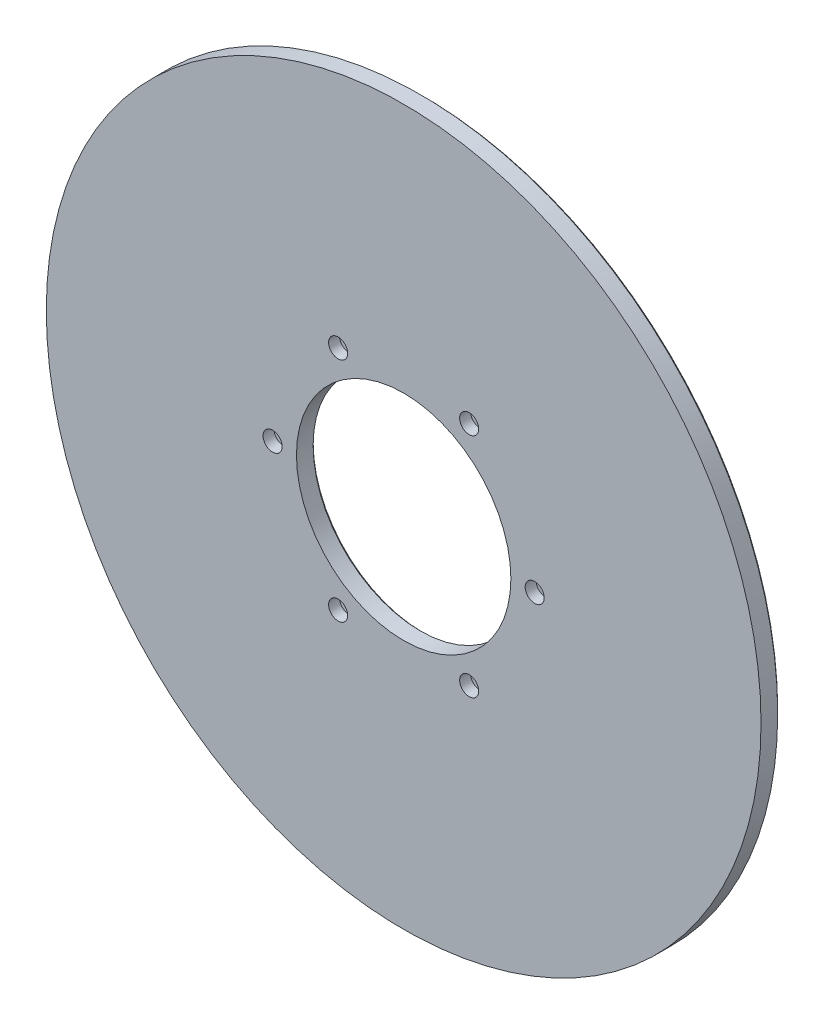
ISO-10303-21;
HEADER;
FILE_DESCRIPTION(('STEP AP214'),'2;1');
FILE_NAME('part.step','',(''),(''),'','','');
FILE_SCHEMA(('AUTOMOTIVE_DESIGN { 1 0 10303 214 1 1 1 1 }'));
ENDSEC;
DATA;
#1=APPLICATION_CONTEXT('core data for automotive mechanical design processes');
#2=APPLICATION_PROTOCOL_DEFINITION('international standard','automotive_design',2000,#1);
#3=PRODUCT_CONTEXT('',#1,'mechanical');
#4=PRODUCT('Part','Part','',(#3));
#5=PRODUCT_RELATED_PRODUCT_CATEGORY('part','',(#4));
#6=PRODUCT_DEFINITION_FORMATION('','',#4);
#7=PRODUCT_DEFINITION_CONTEXT('part definition',#1,'design');
#8=PRODUCT_DEFINITION('design','',#6,#7);
#9=PRODUCT_DEFINITION_SHAPE('','',#8);
#10=(LENGTH_UNIT() NAMED_UNIT(*) SI_UNIT(.MILLI.,.METRE.));
#11=(NAMED_UNIT(*) PLANE_ANGLE_UNIT() SI_UNIT($,.RADIAN.));
#12=(NAMED_UNIT(*) SI_UNIT($,.STERADIAN.) SOLID_ANGLE_UNIT());
#13=UNCERTAINTY_MEASURE_WITH_UNIT(LENGTH_MEASURE(1.E-05),#10,'distance_accuracy_value','');
#14=(GEOMETRIC_REPRESENTATION_CONTEXT(3) GLOBAL_UNCERTAINTY_ASSIGNED_CONTEXT((#13)) GLOBAL_UNIT_ASSIGNED_CONTEXT((#10,
#11,#12)) REPRESENTATION_CONTEXT('',''));
#15=CARTESIAN_POINT('',(0.,0.,0.));
#16=DIRECTION('',(0.,0.,1.));
#17=DIRECTION('',(1.,0.,0.));
#18=AXIS2_PLACEMENT_3D('',#15,#16,#17);
#19=CARTESIAN_POINT('',(-25.2500000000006,-47.6313972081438,3.4));
#20=DIRECTION('',(0.,0.,-1.));
#21=DIRECTION('',(0.,-1.,0.));
#22=AXIS2_PLACEMENT_3D('',#19,#20,#21);
#23=PLANE('',#22);
#24=CARTESIAN_POINT('',(-27.5000000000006,-47.6313972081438,3.4));
#25=DIRECTION('',(0.,0.,1.));
#26=DIRECTION('',(1.,0.,0.));
#27=AXIS2_PLACEMENT_3D('',#24,#25,#26);
#28=CIRCLE('',#27,2.25);
#29=CARTESIAN_POINT('',(-25.2500000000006,-47.6313972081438,3.4));
#30=VERTEX_POINT('',#29);
#31=EDGE_CURVE('E107',#30,#30,#28,.T.);
#32=ORIENTED_EDGE('',*,*,#31,.F.);
#33=EDGE_LOOP('',(#32));
#34=FACE_BOUND('',#33,.T.);
#35=CARTESIAN_POINT('',(-27.5000000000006,-47.6313972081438,3.4));
#36=DIRECTION('',(0.,0.,1.));
#37=DIRECTION('',(1.,0.,0.));
#38=AXIS2_PLACEMENT_3D('',#35,#36,#37);
#39=CIRCLE('',#38,4.);
#40=CARTESIAN_POINT('',(-23.5000000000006,-47.6313972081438,3.4));
#41=VERTEX_POINT('',#40);
#42=EDGE_CURVE('E122',#41,#41,#39,.T.);
#43=ORIENTED_EDGE('',*,*,#42,.T.);
#44=EDGE_LOOP('',(#43));
#45=FACE_BOUND('',#44,.T.);
#46=ADVANCED_FACE('F15',(#34,#45),#23,.F.);
#47=CARTESIAN_POINT('',(29.7499999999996,-47.6313972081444,3.4));
#48=DIRECTION('',(0.,0.,-1.));
#49=DIRECTION('',(0.,-1.,0.));
#50=AXIS2_PLACEMENT_3D('',#47,#48,#49);
#51=PLANE('',#50);
#52=CARTESIAN_POINT('',(27.4999999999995,-47.6313972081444,3.4));
#53=DIRECTION('',(0.,0.,1.));
#54=DIRECTION('',(1.,0.,0.));
#55=AXIS2_PLACEMENT_3D('',#52,#53,#54);
#56=CIRCLE('',#55,2.25);
#57=CARTESIAN_POINT('',(29.7499999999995,-47.6313972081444,3.4));
#58=VERTEX_POINT('',#57);
#59=EDGE_CURVE('E94',#58,#58,#56,.T.);
#60=ORIENTED_EDGE('',*,*,#59,.F.);
#61=EDGE_LOOP('',(#60));
#62=FACE_BOUND('',#61,.T.);
#63=CARTESIAN_POINT('',(27.4999999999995,-47.6313972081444,3.4));
#64=DIRECTION('',(0.,0.,1.));
#65=DIRECTION('',(1.,0.,0.));
#66=AXIS2_PLACEMENT_3D('',#63,#64,#65);
#67=CIRCLE('',#66,4.);
#68=CARTESIAN_POINT('',(31.4999999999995,-47.6313972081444,3.4));
#69=VERTEX_POINT('',#68);
#70=EDGE_CURVE('E103',#69,#69,#67,.T.);
#71=ORIENTED_EDGE('',*,*,#70,.T.);
#72=EDGE_LOOP('',(#71));
#73=FACE_BOUND('',#72,.T.);
#74=ADVANCED_FACE('F180',(#62,#73),#51,.F.);
#75=CARTESIAN_POINT('',(57.25,0.,3.4));
#76=DIRECTION('',(0.,0.,-1.));
#77=DIRECTION('',(0.,-1.,0.));
#78=AXIS2_PLACEMENT_3D('',#75,#76,#77);
#79=PLANE('',#78);
#80=CARTESIAN_POINT('',(55.,0.,3.4));
#81=DIRECTION('',(0.,0.,1.));
#82=DIRECTION('',(1.,0.,0.));
#83=AXIS2_PLACEMENT_3D('',#80,#81,#82);
#84=CIRCLE('',#83,2.25);
#85=CARTESIAN_POINT('',(57.25,0.,3.4));
#86=VERTEX_POINT('',#85);
#87=EDGE_CURVE('E75',#86,#86,#84,.T.);
#88=ORIENTED_EDGE('',*,*,#87,.F.);
#89=EDGE_LOOP('',(#88));
#90=FACE_BOUND('',#89,.T.);
#91=CARTESIAN_POINT('',(55.,0.,3.4));
#92=DIRECTION('',(0.,0.,1.));
#93=DIRECTION('',(1.,0.,0.));
#94=AXIS2_PLACEMENT_3D('',#91,#92,#93);
#95=CIRCLE('',#94,4.);
#96=CARTESIAN_POINT('',(59.,0.,3.4));
#97=VERTEX_POINT('',#96);
#98=EDGE_CURVE('E87',#97,#97,#95,.T.);
#99=ORIENTED_EDGE('',*,*,#98,.T.);
#100=EDGE_LOOP('',(#99));
#101=FACE_BOUND('',#100,.T.);
#102=ADVANCED_FACE('F186',(#90,#101),#79,.F.);
#103=CARTESIAN_POINT('',(29.75,47.631397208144,3.4));
#104=DIRECTION('',(0.,0.,-1.));
#105=DIRECTION('',(0.,-1.,0.));
#106=AXIS2_PLACEMENT_3D('',#103,#104,#105);
#107=PLANE('',#106);
#108=CARTESIAN_POINT('',(27.5,47.631397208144,3.4));
#109=DIRECTION('',(0.,0.,1.));
#110=DIRECTION('',(1.,0.,0.));
#111=AXIS2_PLACEMENT_3D('',#108,#109,#110);
#112=CIRCLE('',#111,2.25);
#113=CARTESIAN_POINT('',(29.75,47.631397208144,3.4));
#114=VERTEX_POINT('',#113);
#115=EDGE_CURVE('E62',#114,#114,#112,.T.);
#116=ORIENTED_EDGE('',*,*,#115,.F.);
#117=EDGE_LOOP('',(#116));
#118=FACE_BOUND('',#117,.T.);
#119=CARTESIAN_POINT('',(27.5,47.631397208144,3.4));
#120=DIRECTION('',(0.,0.,1.));
#121=DIRECTION('',(1.,0.,0.));
#122=AXIS2_PLACEMENT_3D('',#119,#120,#121);
#123=CIRCLE('',#122,4.);
#124=CARTESIAN_POINT('',(31.5,47.631397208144,3.4));
#125=VERTEX_POINT('',#124);
#126=EDGE_CURVE('E74',#125,#125,#123,.T.);
#127=ORIENTED_EDGE('',*,*,#126,.T.);
#128=EDGE_LOOP('',(#127));
#129=FACE_BOUND('',#128,.T.);
#130=ADVANCED_FACE('F266',(#118,#129),#107,.F.);
#131=CARTESIAN_POINT('',(-25.25,47.6313972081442,3.4));
#132=DIRECTION('',(0.,0.,-1.));
#133=DIRECTION('',(0.,-1.,0.));
#134=AXIS2_PLACEMENT_3D('',#131,#132,#133);
#135=PLANE('',#134);
#136=CARTESIAN_POINT('',(-27.5,47.6313972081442,3.4));
#137=DIRECTION('',(0.,0.,1.));
#138=DIRECTION('',(1.,0.,0.));
#139=AXIS2_PLACEMENT_3D('',#136,#137,#138);
#140=CIRCLE('',#139,2.25);
#141=CARTESIAN_POINT('',(-25.25,47.6313972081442,3.4));
#142=VERTEX_POINT('',#141);
#143=EDGE_CURVE('E49',#142,#142,#140,.T.);
#144=ORIENTED_EDGE('',*,*,#143,.F.);
#145=EDGE_LOOP('',(#144));
#146=FACE_BOUND('',#145,.T.);
#147=CARTESIAN_POINT('',(-27.5,47.6313972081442,3.4));
#148=DIRECTION('',(0.,0.,1.));
#149=DIRECTION('',(1.,0.,0.));
#150=AXIS2_PLACEMENT_3D('',#147,#148,#149);
#151=CIRCLE('',#150,4.);
#152=CARTESIAN_POINT('',(-23.5,47.6313972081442,3.4));
#153=VERTEX_POINT('',#152);
#154=EDGE_CURVE('E61',#153,#153,#151,.T.);
#155=ORIENTED_EDGE('',*,*,#154,.T.);
#156=EDGE_LOOP('',(#155));
#157=FACE_BOUND('',#156,.T.);
#158=ADVANCED_FACE('F262',(#146,#157),#135,.F.);
#159=CARTESIAN_POINT('',(-52.75,0.,3.4));
#160=DIRECTION('',(0.,0.,-1.));
#161=DIRECTION('',(0.,-1.,0.));
#162=AXIS2_PLACEMENT_3D('',#159,#160,#161);
#163=PLANE('',#162);
#164=CARTESIAN_POINT('',(-55.,0.,3.4));
#165=DIRECTION('',(0.,0.,1.));
#166=DIRECTION('',(1.,0.,0.));
#167=AXIS2_PLACEMENT_3D('',#164,#165,#166);
#168=CIRCLE('',#167,2.25);
#169=CARTESIAN_POINT('',(-52.75,0.,3.4));
#170=VERTEX_POINT('',#169);
#171=EDGE_CURVE('E31',#170,#170,#168,.T.);
#172=ORIENTED_EDGE('',*,*,#171,.F.);
#173=EDGE_LOOP('',(#172));
#174=FACE_BOUND('',#173,.T.);
#175=CARTESIAN_POINT('',(-55.,0.,3.4));
#176=DIRECTION('',(0.,0.,1.));
#177=DIRECTION('',(1.,0.,0.));
#178=AXIS2_PLACEMENT_3D('',#175,#176,#177);
#179=CIRCLE('',#178,4.);
#180=CARTESIAN_POINT('',(-51.,0.,3.4));
#181=VERTEX_POINT('',#180);
#182=EDGE_CURVE('E45',#181,#181,#179,.T.);
#183=ORIENTED_EDGE('',*,*,#182,.T.);
#184=EDGE_LOOP('',(#183));
#185=FACE_BOUND('',#184,.T.);
#186=ADVANCED_FACE('F198',(#174,#185),#163,.F.);
#187=CARTESIAN_POINT('',(0.,0.,0.));
#188=DIRECTION('',(0.,0.,1.));
#189=DIRECTION('',(1.,0.,0.));
#190=AXIS2_PLACEMENT_3D('',#187,#188,#189);
#191=PLANE('',#190);
#192=CARTESIAN_POINT('',(-55.,0.,0.));
#193=DIRECTION('',(0.,0.,1.));
#194=DIRECTION('',(1.,0.,0.));
#195=AXIS2_PLACEMENT_3D('',#192,#193,#194);
#196=CIRCLE('',#195,2.25);
#197=CARTESIAN_POINT('',(-52.75,0.,0.));
#198=VERTEX_POINT('',#197);
#199=EDGE_CURVE('E38',#198,#198,#196,.T.);
#200=ORIENTED_EDGE('',*,*,#199,.T.);
#201=EDGE_LOOP('',(#200));
#202=FACE_BOUND('',#201,.T.);
#203=CARTESIAN_POINT('',(-27.5,47.6313972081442,0.));
#204=DIRECTION('',(0.,0.,1.));
#205=DIRECTION('',(1.,0.,0.));
#206=AXIS2_PLACEMENT_3D('',#203,#204,#205);
#207=CIRCLE('',#206,2.25);
#208=CARTESIAN_POINT('',(-25.25,47.6313972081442,0.));
#209=VERTEX_POINT('',#208);
#210=EDGE_CURVE('E53',#209,#209,#207,.T.);
#211=ORIENTED_EDGE('',*,*,#210,.T.);
#212=EDGE_LOOP('',(#211));
#213=FACE_BOUND('',#212,.T.);
#214=CARTESIAN_POINT('',(27.5,47.631397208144,0.));
#215=DIRECTION('',(0.,0.,1.));
#216=DIRECTION('',(1.,0.,0.));
#217=AXIS2_PLACEMENT_3D('',#214,#215,#216);
#218=CIRCLE('',#217,2.25);
#219=CARTESIAN_POINT('',(29.75,47.631397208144,0.));
#220=VERTEX_POINT('',#219);
#221=EDGE_CURVE('E66',#220,#220,#218,.T.);
#222=ORIENTED_EDGE('',*,*,#221,.T.);
#223=EDGE_LOOP('',(#222));
#224=FACE_BOUND('',#223,.T.);
#225=CARTESIAN_POINT('',(55.,0.,0.));
#226=DIRECTION('',(0.,0.,1.));
#227=DIRECTION('',(1.,0.,0.));
#228=AXIS2_PLACEMENT_3D('',#225,#226,#227);
#229=CIRCLE('',#228,2.25);
#230=CARTESIAN_POINT('',(57.25,0.,0.));
#231=VERTEX_POINT('',#230);
#232=EDGE_CURVE('E79',#231,#231,#229,.T.);
#233=ORIENTED_EDGE('',*,*,#232,.T.);
#234=EDGE_LOOP('',(#233));
#235=FACE_BOUND('',#234,.T.);
#236=CARTESIAN_POINT('',(27.4999999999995,-47.6313972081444,0.));
#237=DIRECTION('',(0.,0.,1.));
#238=DIRECTION('',(1.,0.,0.));
#239=AXIS2_PLACEMENT_3D('',#236,#237,#238);
#240=CIRCLE('',#239,2.25);
#241=CARTESIAN_POINT('',(29.7499999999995,-47.6313972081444,0.));
#242=VERTEX_POINT('',#241);
#243=EDGE_CURVE('E98',#242,#242,#240,.T.);
#244=ORIENTED_EDGE('',*,*,#243,.T.);
#245=EDGE_LOOP('',(#244));
#246=FACE_BOUND('',#245,.T.);
#247=CARTESIAN_POINT('',(-27.5000000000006,-47.6313972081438,0.));
#248=DIRECTION('',(0.,0.,1.));
#249=DIRECTION('',(1.,0.,0.));
#250=AXIS2_PLACEMENT_3D('',#247,#248,#249);
#251=CIRCLE('',#250,2.25);
#252=CARTESIAN_POINT('',(-25.2500000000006,-47.6313972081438,0.));
#253=VERTEX_POINT('',#252);
#254=EDGE_CURVE('E111',#253,#253,#251,.T.);
#255=ORIENTED_EDGE('',*,*,#254,.T.);
#256=EDGE_LOOP('',(#255));
#257=FACE_BOUND('',#256,.T.);
#258=CARTESIAN_POINT('',(0.,0.,0.));
#259=DIRECTION('',(0.,0.,1.));
#260=DIRECTION('',(1.,0.,0.));
#261=AXIS2_PLACEMENT_3D('',#258,#259,#260);
#262=CIRCLE('',#261,46.);
#263=CARTESIAN_POINT('',(46.,0.,0.));
#264=VERTEX_POINT('',#263);
#265=EDGE_CURVE('E126',#264,#264,#262,.T.);
#266=ORIENTED_EDGE('',*,*,#265,.T.);
#267=EDGE_LOOP('',(#266));
#268=FACE_BOUND('',#267,.T.);
#269=CARTESIAN_POINT('',(0.,0.,0.));
#270=DIRECTION('',(0.,0.,-1.));
#271=DIRECTION('',(1.,0.,0.));
#272=AXIS2_PLACEMENT_3D('',#269,#270,#271);
#273=CIRCLE('',#272,149.);
#274=CARTESIAN_POINT('',(149.,0.,0.));
#275=VERTEX_POINT('',#274);
#276=EDGE_CURVE('E138',#275,#275,#273,.T.);
#277=ORIENTED_EDGE('',*,*,#276,.T.);
#278=EDGE_LOOP('',(#277));
#279=FACE_BOUND('',#278,.T.);
#280=ADVANCED_FACE('F158',(#202,#213,#224,#235,#246,#257,#268,#279),#191,.F.);
#281=CARTESIAN_POINT('',(0.,0.,8.));
#282=DIRECTION('',(0.,0.,1.));
#283=DIRECTION('',(1.,0.,0.));
#284=AXIS2_PLACEMENT_3D('',#281,#282,#283);
#285=PLANE('',#284);
#286=CARTESIAN_POINT('',(0.,0.,8.));
#287=DIRECTION('',(0.,0.,1.));
#288=DIRECTION('',(1.,0.,0.));
#289=AXIS2_PLACEMENT_3D('',#286,#287,#288);
#290=CIRCLE('',#289,45.);
#291=CARTESIAN_POINT('',(45.,0.,8.));
#292=VERTEX_POINT('',#291);
#293=EDGE_CURVE('E22',#292,#292,#290,.T.);
#294=ORIENTED_EDGE('',*,*,#293,.F.);
#295=EDGE_LOOP('',(#294));
#296=FACE_BOUND('',#295,.T.);
#297=CARTESIAN_POINT('',(-55.,0.,8.));
#298=DIRECTION('',(0.,0.,1.));
#299=DIRECTION('',(1.,0.,0.));
#300=AXIS2_PLACEMENT_3D('',#297,#298,#299);
#301=CIRCLE('',#300,4.);
#302=CARTESIAN_POINT('',(-51.,0.,8.));
#303=VERTEX_POINT('',#302);
#304=EDGE_CURVE('E44',#303,#303,#301,.T.);
#305=ORIENTED_EDGE('',*,*,#304,.F.);
#306=EDGE_LOOP('',(#305));
#307=FACE_BOUND('',#306,.T.);
#308=CARTESIAN_POINT('',(-27.5,47.6313972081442,8.));
#309=DIRECTION('',(0.,0.,1.));
#310=DIRECTION('',(1.,0.,0.));
#311=AXIS2_PLACEMENT_3D('',#308,#309,#310);
#312=CIRCLE('',#311,4.);
#313=CARTESIAN_POINT('',(-23.5,47.6313972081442,8.));
#314=VERTEX_POINT('',#313);
#315=EDGE_CURVE('E57',#314,#314,#312,.T.);
#316=ORIENTED_EDGE('',*,*,#315,.F.);
#317=EDGE_LOOP('',(#316));
#318=FACE_BOUND('',#317,.T.);
#319=CARTESIAN_POINT('',(27.5,47.631397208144,8.));
#320=DIRECTION('',(0.,0.,1.));
#321=DIRECTION('',(1.,0.,0.));
#322=AXIS2_PLACEMENT_3D('',#319,#320,#321);
#323=CIRCLE('',#322,4.);
#324=CARTESIAN_POINT('',(31.5,47.631397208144,8.));
#325=VERTEX_POINT('',#324);
#326=EDGE_CURVE('E70',#325,#325,#323,.T.);
#327=ORIENTED_EDGE('',*,*,#326,.F.);
#328=EDGE_LOOP('',(#327));
#329=FACE_BOUND('',#328,.T.);
#330=CARTESIAN_POINT('',(55.,0.,8.));
#331=DIRECTION('',(0.,0.,1.));
#332=DIRECTION('',(1.,0.,0.));
#333=AXIS2_PLACEMENT_3D('',#330,#331,#332);
#334=CIRCLE('',#333,4.);
#335=CARTESIAN_POINT('',(59.,0.,8.));
#336=VERTEX_POINT('',#335);
#337=EDGE_CURVE('E83',#336,#336,#334,.T.);
#338=ORIENTED_EDGE('',*,*,#337,.F.);
#339=EDGE_LOOP('',(#338));
#340=FACE_BOUND('',#339,.T.);
#341=CARTESIAN_POINT('',(27.4999999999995,-47.6313972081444,8.));
#342=DIRECTION('',(0.,0.,1.));
#343=DIRECTION('',(1.,0.,0.));
#344=AXIS2_PLACEMENT_3D('',#341,#342,#343);
#345=CIRCLE('',#344,4.);
#346=CARTESIAN_POINT('',(31.4999999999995,-47.6313972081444,8.));
#347=VERTEX_POINT('',#346);
#348=EDGE_CURVE('E99',#347,#347,#345,.T.);
#349=ORIENTED_EDGE('',*,*,#348,.F.);
#350=EDGE_LOOP('',(#349));
#351=FACE_BOUND('',#350,.T.);
#352=CARTESIAN_POINT('',(-27.5000000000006,-47.6313972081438,8.));
#353=DIRECTION('',(0.,0.,1.));
#354=DIRECTION('',(1.,0.,0.));
#355=AXIS2_PLACEMENT_3D('',#352,#353,#354);
#356=CIRCLE('',#355,4.);
#357=CARTESIAN_POINT('',(-23.5000000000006,-47.6313972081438,8.));
#358=VERTEX_POINT('',#357);
#359=EDGE_CURVE('E118',#358,#358,#356,.T.);
#360=ORIENTED_EDGE('',*,*,#359,.F.);
#361=EDGE_LOOP('',(#360));
#362=FACE_BOUND('',#361,.T.);
#363=CARTESIAN_POINT('',(0.,0.,8.));
#364=DIRECTION('',(0.,0.,1.));
#365=DIRECTION('',(1.,0.,0.));
#366=AXIS2_PLACEMENT_3D('',#363,#364,#365);
#367=CIRCLE('',#366,150.);
#368=CARTESIAN_POINT('',(150.,0.,8.));
#369=VERTEX_POINT('',#368);
#370=EDGE_CURVE('E10',#369,#369,#367,.T.);
#371=ORIENTED_EDGE('',*,*,#370,.T.);
#372=EDGE_LOOP('',(#371));
#373=FACE_BOUND('',#372,.T.);
#374=ADVANCED_FACE('F154',(#296,#307,#318,#329,#340,#351,#362,#373),#285,.T.);
#375=CARTESIAN_POINT('',(0.,0.,8.));
#376=DIRECTION('',(0.,0.,-1.));
#377=DIRECTION('',(-1.,0.,0.));
#378=AXIS2_PLACEMENT_3D('',#375,#376,#377);
#379=CYLINDRICAL_SURFACE('',#378,150.);
#380=CARTESIAN_POINT('',(0.,0.,1.00000000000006));
#381=DIRECTION('',(0.,0.,1.));
#382=DIRECTION('',(1.,0.,0.));
#383=AXIS2_PLACEMENT_3D('',#380,#381,#382);
#384=CIRCLE('',#383,150.);
#385=CARTESIAN_POINT('',(150.,0.,1.00000000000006));
#386=VERTEX_POINT('',#385);
#387=EDGE_CURVE('E134',#386,#386,#384,.T.);
#388=ORIENTED_EDGE('',*,*,#387,.T.);
#389=EDGE_LOOP('',(#388));
#390=FACE_BOUND('',#389,.T.);
#391=ORIENTED_EDGE('',*,*,#370,.F.);
#392=EDGE_LOOP('',(#391));
#393=FACE_BOUND('',#392,.T.);
#394=ADVANCED_FACE('F157',(#390,#393),#379,.T.);
#395=CARTESIAN_POINT('',(0.,0.,8.));
#396=DIRECTION('',(0.,0.,-1.));
#397=DIRECTION('',(-1.,0.,0.));
#398=AXIS2_PLACEMENT_3D('',#395,#396,#397);
#399=CYLINDRICAL_SURFACE('',#398,45.);
#400=CARTESIAN_POINT('',(0.,0.,0.999999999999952));
#401=DIRECTION('',(0.,0.,-1.));
#402=DIRECTION('',(1.,0.,0.));
#403=AXIS2_PLACEMENT_3D('',#400,#401,#402);
#404=CIRCLE('',#403,45.);
#405=CARTESIAN_POINT('',(45.,0.,0.999999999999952));
#406=VERTEX_POINT('',#405);
#407=EDGE_CURVE('E130',#406,#406,#404,.T.);
#408=ORIENTED_EDGE('',*,*,#407,.T.);
#409=EDGE_LOOP('',(#408));
#410=FACE_BOUND('',#409,.T.);
#411=ORIENTED_EDGE('',*,*,#293,.T.);
#412=EDGE_LOOP('',(#411));
#413=FACE_BOUND('',#412,.T.);
#414=ADVANCED_FACE('F242',(#410,#413),#399,.F.);
#415=CARTESIAN_POINT('',(-55.,0.,8.));
#416=DIRECTION('',(0.,0.,1.));
#417=DIRECTION('',(1.,0.,0.));
#418=AXIS2_PLACEMENT_3D('',#415,#416,#417);
#419=CYLINDRICAL_SURFACE('',#418,2.25);
#420=ORIENTED_EDGE('',*,*,#171,.T.);
#421=EDGE_LOOP('',(#420));
#422=FACE_BOUND('',#421,.T.);
#423=ORIENTED_EDGE('',*,*,#199,.F.);
#424=EDGE_LOOP('',(#423));
#425=FACE_BOUND('',#424,.T.);
#426=ADVANCED_FACE('F227',(#422,#425),#419,.F.);
#427=CARTESIAN_POINT('',(-55.,0.,8.));
#428=DIRECTION('',(0.,0.,1.));
#429=DIRECTION('',(1.,0.,0.));
#430=AXIS2_PLACEMENT_3D('',#427,#428,#429);
#431=CYLINDRICAL_SURFACE('',#430,4.);
#432=ORIENTED_EDGE('',*,*,#304,.T.);
#433=EDGE_LOOP('',(#432));
#434=FACE_BOUND('',#433,.T.);
#435=ORIENTED_EDGE('',*,*,#182,.F.);
#436=EDGE_LOOP('',(#435));
#437=FACE_BOUND('',#436,.T.);
#438=ADVANCED_FACE('F151',(#434,#437),#431,.F.);
#439=CARTESIAN_POINT('',(-27.5,47.6313972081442,8.));
#440=DIRECTION('',(0.,0.,1.));
#441=DIRECTION('',(1.,0.,0.));
#442=AXIS2_PLACEMENT_3D('',#439,#440,#441);
#443=CYLINDRICAL_SURFACE('',#442,2.25);
#444=ORIENTED_EDGE('',*,*,#143,.T.);
#445=EDGE_LOOP('',(#444));
#446=FACE_BOUND('',#445,.T.);
#447=ORIENTED_EDGE('',*,*,#210,.F.);
#448=EDGE_LOOP('',(#447));
#449=FACE_BOUND('',#448,.T.);
#450=ADVANCED_FACE('F226',(#446,#449),#443,.F.);
#451=CARTESIAN_POINT('',(-27.5,47.6313972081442,8.));
#452=DIRECTION('',(0.,0.,1.));
#453=DIRECTION('',(1.,0.,0.));
#454=AXIS2_PLACEMENT_3D('',#451,#452,#453);
#455=CYLINDRICAL_SURFACE('',#454,4.);
#456=ORIENTED_EDGE('',*,*,#315,.T.);
#457=EDGE_LOOP('',(#456));
#458=FACE_BOUND('',#457,.T.);
#459=ORIENTED_EDGE('',*,*,#154,.F.);
#460=EDGE_LOOP('',(#459));
#461=FACE_BOUND('',#460,.T.);
#462=ADVANCED_FACE('F246',(#458,#461),#455,.F.);
#463=CARTESIAN_POINT('',(27.5,47.631397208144,8.));
#464=DIRECTION('',(0.,0.,1.));
#465=DIRECTION('',(1.,0.,0.));
#466=AXIS2_PLACEMENT_3D('',#463,#464,#465);
#467=CYLINDRICAL_SURFACE('',#466,2.25);
#468=ORIENTED_EDGE('',*,*,#115,.T.);
#469=EDGE_LOOP('',(#468));
#470=FACE_BOUND('',#469,.T.);
#471=ORIENTED_EDGE('',*,*,#221,.F.);
#472=EDGE_LOOP('',(#471));
#473=FACE_BOUND('',#472,.T.);
#474=ADVANCED_FACE('F238',(#470,#473),#467,.F.);
#475=CARTESIAN_POINT('',(27.5,47.631397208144,8.));
#476=DIRECTION('',(0.,0.,1.));
#477=DIRECTION('',(1.,0.,0.));
#478=AXIS2_PLACEMENT_3D('',#475,#476,#477);
#479=CYLINDRICAL_SURFACE('',#478,4.);
#480=ORIENTED_EDGE('',*,*,#326,.T.);
#481=EDGE_LOOP('',(#480));
#482=FACE_BOUND('',#481,.T.);
#483=ORIENTED_EDGE('',*,*,#126,.F.);
#484=EDGE_LOOP('',(#483));
#485=FACE_BOUND('',#484,.T.);
#486=ADVANCED_FACE('F234',(#482,#485),#479,.F.);
#487=CARTESIAN_POINT('',(55.,0.,8.));
#488=DIRECTION('',(0.,0.,1.));
#489=DIRECTION('',(1.,0.,0.));
#490=AXIS2_PLACEMENT_3D('',#487,#488,#489);
#491=CYLINDRICAL_SURFACE('',#490,2.25);
#492=ORIENTED_EDGE('',*,*,#87,.T.);
#493=EDGE_LOOP('',(#492));
#494=FACE_BOUND('',#493,.T.);
#495=ORIENTED_EDGE('',*,*,#232,.F.);
#496=EDGE_LOOP('',(#495));
#497=FACE_BOUND('',#496,.T.);
#498=ADVANCED_FACE('F230',(#494,#497),#491,.F.);
#499=CARTESIAN_POINT('',(55.,0.,8.));
#500=DIRECTION('',(0.,0.,1.));
#501=DIRECTION('',(1.,0.,0.));
#502=AXIS2_PLACEMENT_3D('',#499,#500,#501);
#503=CYLINDRICAL_SURFACE('',#502,4.);
#504=ORIENTED_EDGE('',*,*,#337,.T.);
#505=EDGE_LOOP('',(#504));
#506=FACE_BOUND('',#505,.T.);
#507=ORIENTED_EDGE('',*,*,#98,.F.);
#508=EDGE_LOOP('',(#507));
#509=FACE_BOUND('',#508,.T.);
#510=ADVANCED_FACE('F218',(#506,#509),#503,.F.);
#511=CARTESIAN_POINT('',(27.4999999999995,-47.6313972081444,8.));
#512=DIRECTION('',(0.,0.,1.));
#513=DIRECTION('',(1.,0.,0.));
#514=AXIS2_PLACEMENT_3D('',#511,#512,#513);
#515=CYLINDRICAL_SURFACE('',#514,2.25);
#516=ORIENTED_EDGE('',*,*,#59,.T.);
#517=EDGE_LOOP('',(#516));
#518=FACE_BOUND('',#517,.T.);
#519=ORIENTED_EDGE('',*,*,#243,.F.);
#520=EDGE_LOOP('',(#519));
#521=FACE_BOUND('',#520,.T.);
#522=ADVANCED_FACE('F216',(#518,#521),#515,.F.);
#523=CARTESIAN_POINT('',(27.4999999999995,-47.6313972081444,8.));
#524=DIRECTION('',(0.,0.,1.));
#525=DIRECTION('',(1.,0.,0.));
#526=AXIS2_PLACEMENT_3D('',#523,#524,#525);
#527=CYLINDRICAL_SURFACE('',#526,4.);
#528=ORIENTED_EDGE('',*,*,#348,.T.);
#529=EDGE_LOOP('',(#528));
#530=FACE_BOUND('',#529,.T.);
#531=ORIENTED_EDGE('',*,*,#70,.F.);
#532=EDGE_LOOP('',(#531));
#533=FACE_BOUND('',#532,.T.);
#534=ADVANCED_FACE('F192',(#530,#533),#527,.F.);
#535=CARTESIAN_POINT('',(-27.5000000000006,-47.6313972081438,8.));
#536=DIRECTION('',(0.,0.,1.));
#537=DIRECTION('',(1.,0.,0.));
#538=AXIS2_PLACEMENT_3D('',#535,#536,#537);
#539=CYLINDRICAL_SURFACE('',#538,2.25);
#540=ORIENTED_EDGE('',*,*,#31,.T.);
#541=EDGE_LOOP('',(#540));
#542=FACE_BOUND('',#541,.T.);
#543=ORIENTED_EDGE('',*,*,#254,.F.);
#544=EDGE_LOOP('',(#543));
#545=FACE_BOUND('',#544,.T.);
#546=ADVANCED_FACE('F175',(#542,#545),#539,.F.);
#547=CARTESIAN_POINT('',(-27.5000000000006,-47.6313972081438,8.));
#548=DIRECTION('',(0.,0.,1.));
#549=DIRECTION('',(1.,0.,0.));
#550=AXIS2_PLACEMENT_3D('',#547,#548,#549);
#551=CYLINDRICAL_SURFACE('',#550,4.);
#552=ORIENTED_EDGE('',*,*,#359,.T.);
#553=EDGE_LOOP('',(#552));
#554=FACE_BOUND('',#553,.T.);
#555=ORIENTED_EDGE('',*,*,#42,.F.);
#556=EDGE_LOOP('',(#555));
#557=FACE_BOUND('',#556,.T.);
#558=ADVANCED_FACE('F171',(#554,#557),#551,.F.);
#559=CARTESIAN_POINT('',(0.,0.,0.));
#560=DIRECTION('',(0.,0.,-1.));
#561=DIRECTION('',(-1.,0.,0.));
#562=AXIS2_PLACEMENT_3D('',#559,#560,#561);
#563=CONICAL_SURFACE('',#562,46.,0.785398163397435);
#564=ORIENTED_EDGE('',*,*,#265,.F.);
#565=EDGE_LOOP('',(#564));
#566=FACE_BOUND('',#565,.T.);
#567=ORIENTED_EDGE('',*,*,#407,.F.);
#568=EDGE_LOOP('',(#567));
#569=FACE_BOUND('',#568,.T.);
#570=ADVANCED_FACE('F174',(#566,#569),#563,.F.);
#571=CARTESIAN_POINT('',(0.,0.,1.00000000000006));
#572=DIRECTION('',(0.,0.,1.));
#573=DIRECTION('',(1.,0.,0.));
#574=AXIS2_PLACEMENT_3D('',#571,#572,#573);
#575=CONICAL_SURFACE('',#574,150.,0.785398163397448);
#576=ORIENTED_EDGE('',*,*,#387,.F.);
#577=EDGE_LOOP('',(#576));
#578=FACE_BOUND('',#577,.T.);
#579=ORIENTED_EDGE('',*,*,#276,.F.);
#580=EDGE_LOOP('',(#579));
#581=FACE_BOUND('',#580,.T.);
#582=ADVANCED_FACE('F205',(#578,#581),#575,.T.);
#583=CLOSED_SHELL('',(#46,#74,#102,#130,#158,#186,#280,#374,#394,#414,#426,#438,#450,#462,#474,
#486,#498,#510,#522,#534,#546,#558,#570,#582));
#584=MANIFOLD_SOLID_BREP('B1',#583);
#585=ADVANCED_BREP_SHAPE_REPRESENTATION('',(#18,#584),#14);
#586=SHAPE_DEFINITION_REPRESENTATION(#9,#585);
ENDSEC;
END-ISO-10303-21;
